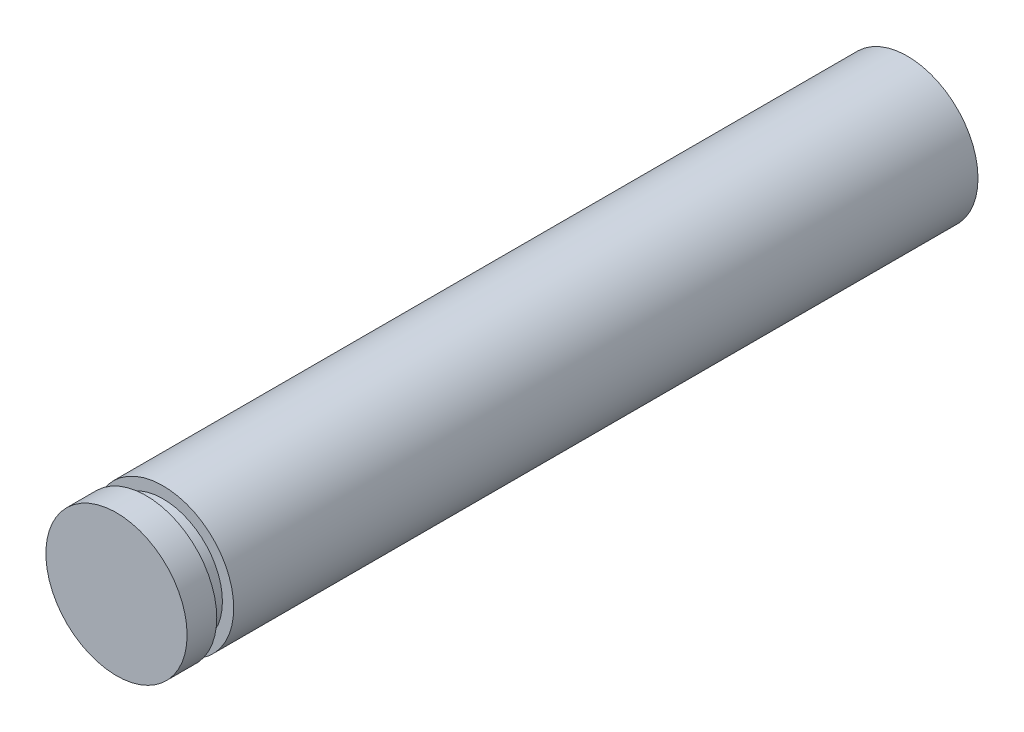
ISO-10303-21;
HEADER;
FILE_DESCRIPTION(('STEP AP214'),'2;1');
FILE_NAME('part.step','',(''),(''),'','','');
FILE_SCHEMA(('AUTOMOTIVE_DESIGN { 1 0 10303 214 1 1 1 1 }'));
ENDSEC;
DATA;
#1=APPLICATION_CONTEXT('core data for automotive mechanical design processes');
#2=APPLICATION_PROTOCOL_DEFINITION('international standard','automotive_design',2000,#1);
#3=PRODUCT_CONTEXT('',#1,'mechanical');
#4=PRODUCT('Part','Part','',(#3));
#5=PRODUCT_RELATED_PRODUCT_CATEGORY('part','',(#4));
#6=PRODUCT_DEFINITION_FORMATION('','',#4);
#7=PRODUCT_DEFINITION_CONTEXT('part definition',#1,'design');
#8=PRODUCT_DEFINITION('design','',#6,#7);
#9=PRODUCT_DEFINITION_SHAPE('','',#8);
#10=(LENGTH_UNIT() NAMED_UNIT(*) SI_UNIT(.MILLI.,.METRE.));
#11=(NAMED_UNIT(*) PLANE_ANGLE_UNIT() SI_UNIT($,.RADIAN.));
#12=(NAMED_UNIT(*) SI_UNIT($,.STERADIAN.) SOLID_ANGLE_UNIT());
#13=UNCERTAINTY_MEASURE_WITH_UNIT(LENGTH_MEASURE(1.E-05),#10,'distance_accuracy_value','');
#14=(GEOMETRIC_REPRESENTATION_CONTEXT(3) GLOBAL_UNCERTAINTY_ASSIGNED_CONTEXT((#13)) GLOBAL_UNIT_ASSIGNED_CONTEXT((#10,
#11,#12)) REPRESENTATION_CONTEXT('',''));
#15=CARTESIAN_POINT('',(0.,0.,0.));
#16=DIRECTION('',(0.,0.,1.));
#17=DIRECTION('',(1.,0.,0.));
#18=AXIS2_PLACEMENT_3D('',#15,#16,#17);
#19=CARTESIAN_POINT('',(0.,0.,17.78));
#20=DIRECTION('',(0.,0.,-1.));
#21=DIRECTION('',(-1.,0.,0.));
#22=AXIS2_PLACEMENT_3D('',#19,#20,#21);
#23=CYLINDRICAL_SURFACE('',#22,3.175);
#24=CARTESIAN_POINT('',(0.,0.,-17.78));
#25=DIRECTION('',(0.,0.,1.));
#26=DIRECTION('',(1.,0.,0.));
#27=AXIS2_PLACEMENT_3D('',#24,#25,#26);
#28=CIRCLE('',#27,3.175);
#29=CARTESIAN_POINT('',(3.175,0.,-17.78));
#30=VERTEX_POINT('',#29);
#31=EDGE_CURVE('E38',#30,#30,#28,.T.);
#32=ORIENTED_EDGE('',*,*,#31,.T.);
#33=EDGE_LOOP('',(#32));
#34=FACE_BOUND('',#33,.T.);
#35=CARTESIAN_POINT('',(0.,0.,15.6845));
#36=DIRECTION('',(0.,0.,1.));
#37=DIRECTION('',(1.,0.,0.));
#38=AXIS2_PLACEMENT_3D('',#35,#36,#37);
#39=CIRCLE('',#38,3.175);
#40=CARTESIAN_POINT('',(3.175,0.,15.6845));
#41=VERTEX_POINT('',#40);
#42=EDGE_CURVE('E45',#41,#41,#39,.T.);
#43=ORIENTED_EDGE('',*,*,#42,.F.);
#44=EDGE_LOOP('',(#43));
#45=FACE_BOUND('',#44,.T.);
#46=ADVANCED_FACE('F35',(#34,#45),#23,.T.);
#47=CARTESIAN_POINT('',(0.,0.,-17.78));
#48=DIRECTION('',(0.,0.,1.));
#49=DIRECTION('',(1.,0.,0.));
#50=AXIS2_PLACEMENT_3D('',#47,#48,#49);
#51=PLANE('',#50);
#52=ORIENTED_EDGE('',*,*,#31,.F.);
#53=EDGE_LOOP('',(#52));
#54=FACE_BOUND('',#53,.T.);
#55=ADVANCED_FACE('F65',(#54),#51,.F.);
#56=CARTESIAN_POINT('',(0.,0.,15.6845));
#57=DIRECTION('',(0.,0.,1.));
#58=DIRECTION('',(1.,0.,0.));
#59=AXIS2_PLACEMENT_3D('',#56,#57,#58);
#60=PLANE('',#59);
#61=ORIENTED_EDGE('',*,*,#42,.T.);
#62=EDGE_LOOP('',(#61));
#63=FACE_BOUND('',#62,.T.);
#64=CARTESIAN_POINT('',(0.,0.,15.6845));
#65=DIRECTION('',(0.,0.,1.));
#66=DIRECTION('',(1.,0.,0.));
#67=AXIS2_PLACEMENT_3D('',#64,#65,#66);
#68=CIRCLE('',#67,2.667);
#69=CARTESIAN_POINT('',(2.667,0.,15.6845));
#70=VERTEX_POINT('',#69);
#71=EDGE_CURVE('E55',#70,#70,#68,.T.);
#72=ORIENTED_EDGE('',*,*,#71,.F.);
#73=EDGE_LOOP('',(#72));
#74=FACE_BOUND('',#73,.T.);
#75=ADVANCED_FACE('F62',(#63,#74),#60,.T.);
#76=CARTESIAN_POINT('',(0.,0.,16.4465));
#77=DIRECTION('',(0.,0.,-1.));
#78=DIRECTION('',(-1.,0.,0.));
#79=AXIS2_PLACEMENT_3D('',#76,#77,#78);
#80=PLANE('',#79);
#81=CARTESIAN_POINT('',(0.,0.,16.4465));
#82=DIRECTION('',(0.,0.,1.));
#83=DIRECTION('',(1.,0.,0.));
#84=AXIS2_PLACEMENT_3D('',#81,#82,#83);
#85=CIRCLE('',#84,2.667);
#86=CARTESIAN_POINT('',(2.667,0.,16.4465));
#87=VERTEX_POINT('',#86);
#88=EDGE_CURVE('E52',#87,#87,#85,.T.);
#89=ORIENTED_EDGE('',*,*,#88,.T.);
#90=EDGE_LOOP('',(#89));
#91=FACE_BOUND('',#90,.T.);
#92=CARTESIAN_POINT('',(0.,0.,16.4465));
#93=DIRECTION('',(0.,0.,1.));
#94=DIRECTION('',(1.,0.,0.));
#95=AXIS2_PLACEMENT_3D('',#92,#93,#94);
#96=CIRCLE('',#95,3.175);
#97=CARTESIAN_POINT('',(3.175,0.,16.4465));
#98=VERTEX_POINT('',#97);
#99=EDGE_CURVE('E49',#98,#98,#96,.T.);
#100=ORIENTED_EDGE('',*,*,#99,.F.);
#101=EDGE_LOOP('',(#100));
#102=FACE_BOUND('',#101,.T.);
#103=ADVANCED_FACE('F64',(#91,#102),#80,.T.);
#104=CARTESIAN_POINT('',(0.,0.,17.78));
#105=DIRECTION('',(0.,0.,1.));
#106=DIRECTION('',(1.,0.,0.));
#107=AXIS2_PLACEMENT_3D('',#104,#105,#106);
#108=CYLINDRICAL_SURFACE('',#107,2.667);
#109=ORIENTED_EDGE('',*,*,#71,.T.);
#110=EDGE_LOOP('',(#109));
#111=FACE_BOUND('',#110,.T.);
#112=ORIENTED_EDGE('',*,*,#88,.F.);
#113=EDGE_LOOP('',(#112));
#114=FACE_BOUND('',#113,.T.);
#115=ADVANCED_FACE('F59',(#111,#114),#108,.T.);
#116=CARTESIAN_POINT('',(0.,0.,17.78));
#117=DIRECTION('',(0.,0.,1.));
#118=DIRECTION('',(1.,0.,0.));
#119=AXIS2_PLACEMENT_3D('',#116,#117,#118);
#120=PLANE('',#119);
#121=CARTESIAN_POINT('',(0.,0.,17.78));
#122=DIRECTION('',(0.,0.,1.));
#123=DIRECTION('',(1.,0.,0.));
#124=AXIS2_PLACEMENT_3D('',#121,#122,#123);
#125=CIRCLE('',#124,3.175);
#126=CARTESIAN_POINT('',(3.175,0.,17.78));
#127=VERTEX_POINT('',#126);
#128=EDGE_CURVE('E10',#127,#127,#125,.T.);
#129=ORIENTED_EDGE('',*,*,#128,.T.);
#130=EDGE_LOOP('',(#129));
#131=FACE_BOUND('',#130,.T.);
#132=ADVANCED_FACE('F83',(#131),#120,.T.);
#133=ORIENTED_EDGE('',*,*,#128,.F.);
#134=EDGE_LOOP('',(#133));
#135=FACE_BOUND('',#134,.T.);
#136=ORIENTED_EDGE('',*,*,#99,.T.);
#137=EDGE_LOOP('',(#136));
#138=FACE_BOUND('',#137,.T.);
#139=ADVANCED_FACE('F78',(#135,#138),#23,.T.);
#140=CLOSED_SHELL('',(#46,#55,#75,#103,#115,#132,#139));
#141=MANIFOLD_SOLID_BREP('B2',#140);
#142=ADVANCED_BREP_SHAPE_REPRESENTATION('',(#18,#141),#14);
#143=SHAPE_DEFINITION_REPRESENTATION(#9,#142);
ENDSEC;
END-ISO-10303-21;
